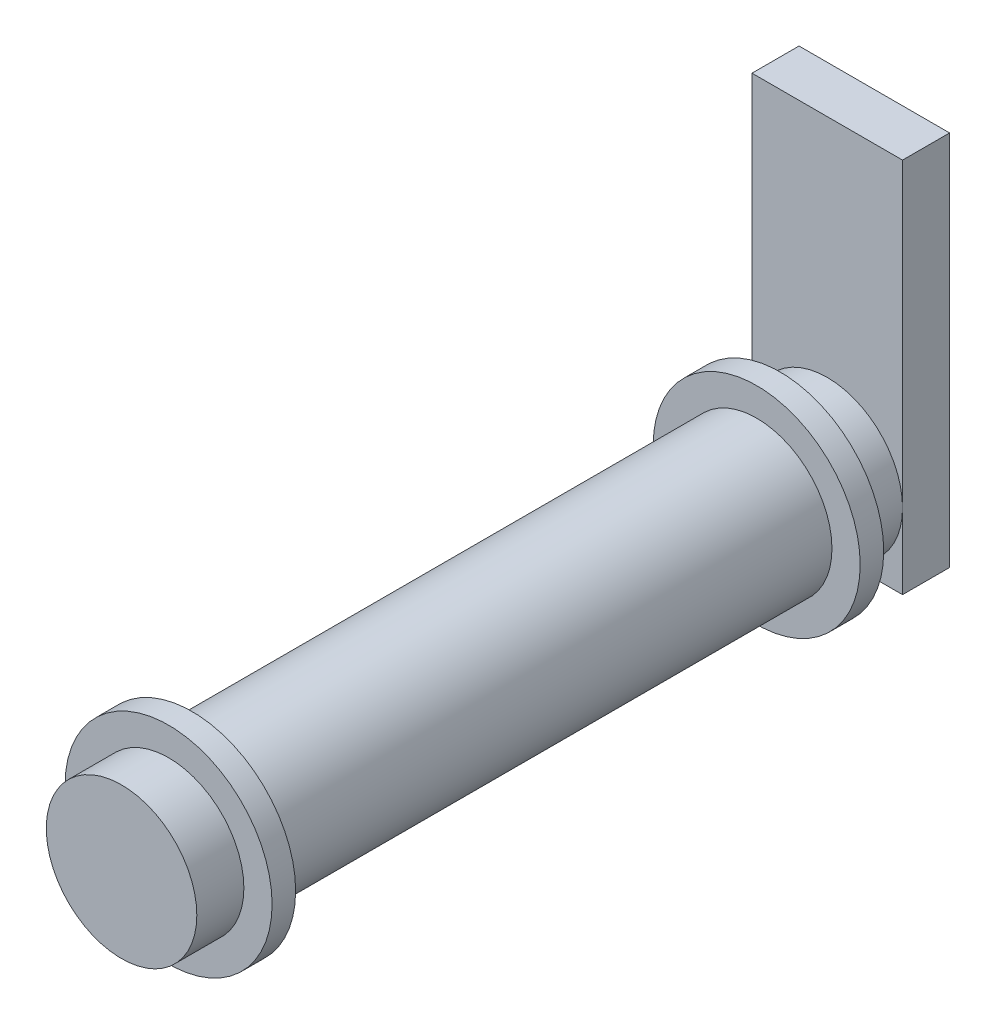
from build123d import *

# Parameters (mm, degrees)
ESQUISSE1_R                = 16
BOSS_EXTRU_1_DEPTH         = 150
ESQUISSE2_W                = 32
ESQUISSE2_H                = 80
BOSS_EXTRU_2_DEPTH         = 10
ESQUISSE3_R                = 22
BOSS_EXTRU_3_DEPTH         = 5
R_P_TITION_LIN_AIRE1_COUNT = 2
R_P_TITION_LIN_AIRE1_PITCH = 125


with BuildPart() as part:
    # Esquisse1 → Boss.-Extru.1 (new body)
    with BuildSketch(Plane.XY):
        Circle(ESQUISSE1_R)
    extrude(amount=BOSS_EXTRU_1_DEPTH)

    # Esquisse2 → Boss.-Extru.2 (add)
    with BuildSketch(Plane(origin=(0, 0, 0), x_dir=(-1, 0, 0), z_dir=(0, 0, -1))):
        with Locations((0, 24)):
            Rectangle(ESQUISSE2_W, ESQUISSE2_H)
    extrude(amount=BOSS_EXTRU_2_DEPTH)

    # Esquisse3 → Boss.-Extru.3 (add)
    with BuildSketch(Plane.XY.offset(10)):
        Circle(ESQUISSE3_R)
    boss_extru_3 = extrude(amount=BOSS_EXTRU_3_DEPTH)

    # R_p_tition lin_aire1: Boss.-Extru.3 ×2
    with Locations(*[(0, 0, i * R_P_TITION_LIN_AIRE1_PITCH) for i in range(1, R_P_TITION_LIN_AIRE1_COUNT)]):
        add(boss_extru_3)


solid = part.part
